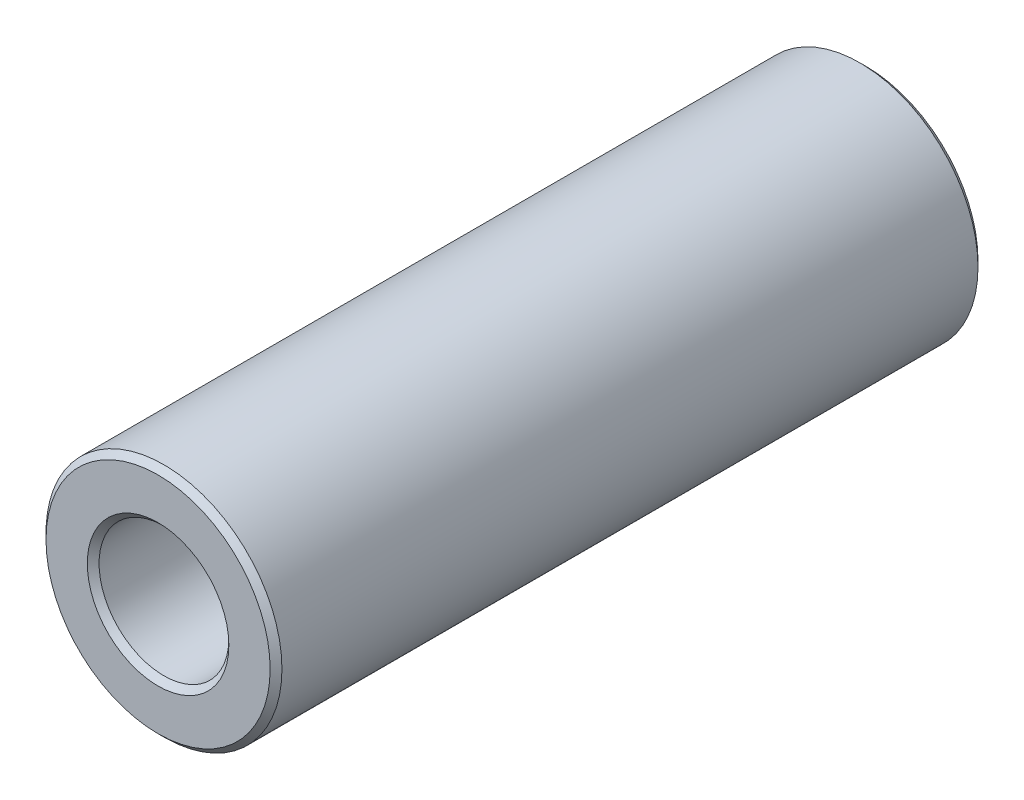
ISO-10303-21;
HEADER;
FILE_DESCRIPTION(('STEP AP214'),'2;1');
FILE_NAME('part.step','',(''),(''),'','','');
FILE_SCHEMA(('AUTOMOTIVE_DESIGN { 1 0 10303 214 1 1 1 1 }'));
ENDSEC;
DATA;
#1=APPLICATION_CONTEXT('core data for automotive mechanical design processes');
#2=APPLICATION_PROTOCOL_DEFINITION('international standard','automotive_design',2000,#1);
#3=PRODUCT_CONTEXT('',#1,'mechanical');
#4=PRODUCT('Part','Part','',(#3));
#5=PRODUCT_RELATED_PRODUCT_CATEGORY('part','',(#4));
#6=PRODUCT_DEFINITION_FORMATION('','',#4);
#7=PRODUCT_DEFINITION_CONTEXT('part definition',#1,'design');
#8=PRODUCT_DEFINITION('design','',#6,#7);
#9=PRODUCT_DEFINITION_SHAPE('','',#8);
#10=(LENGTH_UNIT() NAMED_UNIT(*) SI_UNIT(.MILLI.,.METRE.));
#11=(NAMED_UNIT(*) PLANE_ANGLE_UNIT() SI_UNIT($,.RADIAN.));
#12=(NAMED_UNIT(*) SI_UNIT($,.STERADIAN.) SOLID_ANGLE_UNIT());
#13=UNCERTAINTY_MEASURE_WITH_UNIT(LENGTH_MEASURE(1.E-05),#10,'distance_accuracy_value','');
#14=(GEOMETRIC_REPRESENTATION_CONTEXT(3) GLOBAL_UNCERTAINTY_ASSIGNED_CONTEXT((#13)) GLOBAL_UNIT_ASSIGNED_CONTEXT((#10,
#11,#12)) REPRESENTATION_CONTEXT('',''));
#15=CARTESIAN_POINT('',(0.,0.,0.));
#16=DIRECTION('',(0.,0.,1.));
#17=DIRECTION('',(1.,0.,0.));
#18=AXIS2_PLACEMENT_3D('',#15,#16,#17);
#19=CARTESIAN_POINT('',(0.,0.,6.));
#20=DIRECTION('',(0.,0.,1.));
#21=DIRECTION('',(1.,0.,0.));
#22=AXIS2_PLACEMENT_3D('',#19,#20,#21);
#23=PLANE('',#22);
#24=CARTESIAN_POINT('',(0.,0.,6.));
#25=DIRECTION('',(0.,0.,1.));
#26=DIRECTION('',(1.,0.,0.));
#27=AXIS2_PLACEMENT_3D('',#24,#25,#26);
#28=CIRCLE('',#27,1.2);
#29=CARTESIAN_POINT('',(1.2,0.,6.));
#30=VERTEX_POINT('',#29);
#31=EDGE_CURVE('E10',#30,#30,#28,.F.);
#32=ORIENTED_EDGE('',*,*,#31,.T.);
#33=EDGE_LOOP('',(#32));
#34=FACE_BOUND('',#33,.T.);
#35=CARTESIAN_POINT('',(0.,0.,6.));
#36=DIRECTION('',(0.,0.,1.));
#37=DIRECTION('',(1.,0.,0.));
#38=AXIS2_PLACEMENT_3D('',#35,#36,#37);
#39=CIRCLE('',#38,1.9);
#40=CARTESIAN_POINT('',(1.9,0.,6.));
#41=VERTEX_POINT('',#40);
#42=EDGE_CURVE('E45',#41,#41,#39,.T.);
#43=ORIENTED_EDGE('',*,*,#42,.T.);
#44=EDGE_LOOP('',(#43));
#45=FACE_BOUND('',#44,.T.);
#46=ADVANCED_FACE('F37',(#34,#45),#23,.T.);
#47=CARTESIAN_POINT('',(0.,0.,-6.));
#48=DIRECTION('',(0.,0.,1.));
#49=DIRECTION('',(1.,0.,0.));
#50=AXIS2_PLACEMENT_3D('',#47,#48,#49);
#51=PLANE('',#50);
#52=CARTESIAN_POINT('',(0.,0.,-6.));
#53=DIRECTION('',(0.,0.,1.));
#54=DIRECTION('',(1.,0.,0.));
#55=AXIS2_PLACEMENT_3D('',#52,#53,#54);
#56=CIRCLE('',#55,1.9);
#57=CARTESIAN_POINT('',(1.9,0.,-6.));
#58=VERTEX_POINT('',#57);
#59=EDGE_CURVE('E63',#58,#58,#56,.F.);
#60=ORIENTED_EDGE('',*,*,#59,.T.);
#61=EDGE_LOOP('',(#60));
#62=FACE_BOUND('',#61,.T.);
#63=CARTESIAN_POINT('',(0.,0.,-6.));
#64=DIRECTION('',(0.,0.,1.));
#65=DIRECTION('',(1.,0.,0.));
#66=AXIS2_PLACEMENT_3D('',#63,#64,#65);
#67=CIRCLE('',#66,1.2);
#68=CARTESIAN_POINT('',(1.2,0.,-6.));
#69=VERTEX_POINT('',#68);
#70=EDGE_CURVE('E67',#69,#69,#67,.T.);
#71=ORIENTED_EDGE('',*,*,#70,.T.);
#72=EDGE_LOOP('',(#71));
#73=FACE_BOUND('',#72,.T.);
#74=ADVANCED_FACE('F89',(#62,#73),#51,.F.);
#75=CARTESIAN_POINT('',(0.,0.,6.));
#76=DIRECTION('',(0.,0.,-1.));
#77=DIRECTION('',(-1.,0.,0.));
#78=AXIS2_PLACEMENT_3D('',#75,#76,#77);
#79=CYLINDRICAL_SURFACE('',#78,2.);
#80=CARTESIAN_POINT('',(0.,0.,-5.9));
#81=DIRECTION('',(0.,0.,1.));
#82=DIRECTION('',(1.,0.,0.));
#83=AXIS2_PLACEMENT_3D('',#80,#81,#82);
#84=CIRCLE('',#83,2.);
#85=CARTESIAN_POINT('',(2.,0.,-5.9));
#86=VERTEX_POINT('',#85);
#87=EDGE_CURVE('E71',#86,#86,#84,.T.);
#88=ORIENTED_EDGE('',*,*,#87,.T.);
#89=EDGE_LOOP('',(#88));
#90=FACE_BOUND('',#89,.T.);
#91=CARTESIAN_POINT('',(0.,0.,5.9));
#92=DIRECTION('',(0.,0.,1.));
#93=DIRECTION('',(1.,0.,0.));
#94=AXIS2_PLACEMENT_3D('',#91,#92,#93);
#95=CIRCLE('',#94,2.);
#96=CARTESIAN_POINT('',(2.,0.,5.9));
#97=VERTEX_POINT('',#96);
#98=EDGE_CURVE('E74',#97,#97,#95,.F.);
#99=ORIENTED_EDGE('',*,*,#98,.T.);
#100=EDGE_LOOP('',(#99));
#101=FACE_BOUND('',#100,.T.);
#102=ADVANCED_FACE('F78',(#90,#101),#79,.T.);
#103=CARTESIAN_POINT('',(0.,0.,6.));
#104=DIRECTION('',(0.,0.,-1.));
#105=DIRECTION('',(-1.,0.,0.));
#106=AXIS2_PLACEMENT_3D('',#103,#104,#105);
#107=CYLINDRICAL_SURFACE('',#106,1.1);
#108=CARTESIAN_POINT('',(0.,0.,-5.9));
#109=DIRECTION('',(0.,0.,1.));
#110=DIRECTION('',(1.,0.,0.));
#111=AXIS2_PLACEMENT_3D('',#108,#109,#110);
#112=CIRCLE('',#111,1.1);
#113=CARTESIAN_POINT('',(1.1,0.,-5.9));
#114=VERTEX_POINT('',#113);
#115=EDGE_CURVE('E51',#114,#114,#112,.F.);
#116=ORIENTED_EDGE('',*,*,#115,.T.);
#117=EDGE_LOOP('',(#116));
#118=FACE_BOUND('',#117,.T.);
#119=CARTESIAN_POINT('',(0.,0.,5.9));
#120=DIRECTION('',(0.,0.,1.));
#121=DIRECTION('',(1.,0.,0.));
#122=AXIS2_PLACEMENT_3D('',#119,#120,#121);
#123=CIRCLE('',#122,1.1);
#124=CARTESIAN_POINT('',(1.1,0.,5.9));
#125=VERTEX_POINT('',#124);
#126=EDGE_CURVE('E58',#125,#125,#123,.T.);
#127=ORIENTED_EDGE('',*,*,#126,.T.);
#128=EDGE_LOOP('',(#127));
#129=FACE_BOUND('',#128,.T.);
#130=ADVANCED_FACE('F97',(#118,#129),#107,.F.);
#131=CARTESIAN_POINT('',(0.,0.,-5.9));
#132=DIRECTION('',(0.,0.,1.));
#133=DIRECTION('',(1.,0.,0.));
#134=AXIS2_PLACEMENT_3D('',#131,#132,#133);
#135=CONICAL_SURFACE('',#134,2.,0.785398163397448);
#136=ORIENTED_EDGE('',*,*,#59,.F.);
#137=EDGE_LOOP('',(#136));
#138=FACE_BOUND('',#137,.T.);
#139=ORIENTED_EDGE('',*,*,#87,.F.);
#140=EDGE_LOOP('',(#139));
#141=FACE_BOUND('',#140,.T.);
#142=ADVANCED_FACE('F102',(#138,#141),#135,.T.);
#143=CARTESIAN_POINT('',(0.,0.,-6.));
#144=DIRECTION('',(0.,0.,-1.));
#145=DIRECTION('',(-1.,0.,0.));
#146=AXIS2_PLACEMENT_3D('',#143,#144,#145);
#147=CONICAL_SURFACE('',#146,1.2,0.785398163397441);
#148=ORIENTED_EDGE('',*,*,#115,.F.);
#149=EDGE_LOOP('',(#148));
#150=FACE_BOUND('',#149,.T.);
#151=ORIENTED_EDGE('',*,*,#70,.F.);
#152=EDGE_LOOP('',(#151));
#153=FACE_BOUND('',#152,.T.);
#154=ADVANCED_FACE('F86',(#150,#153),#147,.F.);
#155=CARTESIAN_POINT('',(0.,0.,5.9));
#156=DIRECTION('',(0.,0.,1.));
#157=DIRECTION('',(1.,0.,0.));
#158=AXIS2_PLACEMENT_3D('',#155,#156,#157);
#159=CONICAL_SURFACE('',#158,1.1,0.785398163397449);
#160=ORIENTED_EDGE('',*,*,#31,.F.);
#161=EDGE_LOOP('',(#160));
#162=FACE_BOUND('',#161,.T.);
#163=ORIENTED_EDGE('',*,*,#126,.F.);
#164=EDGE_LOOP('',(#163));
#165=FACE_BOUND('',#164,.T.);
#166=ADVANCED_FACE('F82',(#162,#165),#159,.F.);
#167=CARTESIAN_POINT('',(0.,0.,6.));
#168=DIRECTION('',(0.,0.,-1.));
#169=DIRECTION('',(-1.,0.,0.));
#170=AXIS2_PLACEMENT_3D('',#167,#168,#169);
#171=CONICAL_SURFACE('',#170,1.9,0.785398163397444);
#172=ORIENTED_EDGE('',*,*,#98,.F.);
#173=EDGE_LOOP('',(#172));
#174=FACE_BOUND('',#173,.T.);
#175=ORIENTED_EDGE('',*,*,#42,.F.);
#176=EDGE_LOOP('',(#175));
#177=FACE_BOUND('',#176,.T.);
#178=ADVANCED_FACE('F39',(#174,#177),#171,.T.);
#179=CLOSED_SHELL('',(#46,#74,#102,#130,#142,#154,#166,#178));
#180=MANIFOLD_SOLID_BREP('B2',#179);
#181=ADVANCED_BREP_SHAPE_REPRESENTATION('',(#18,#180),#14);
#182=SHAPE_DEFINITION_REPRESENTATION(#9,#181);
ENDSEC;
END-ISO-10303-21;
